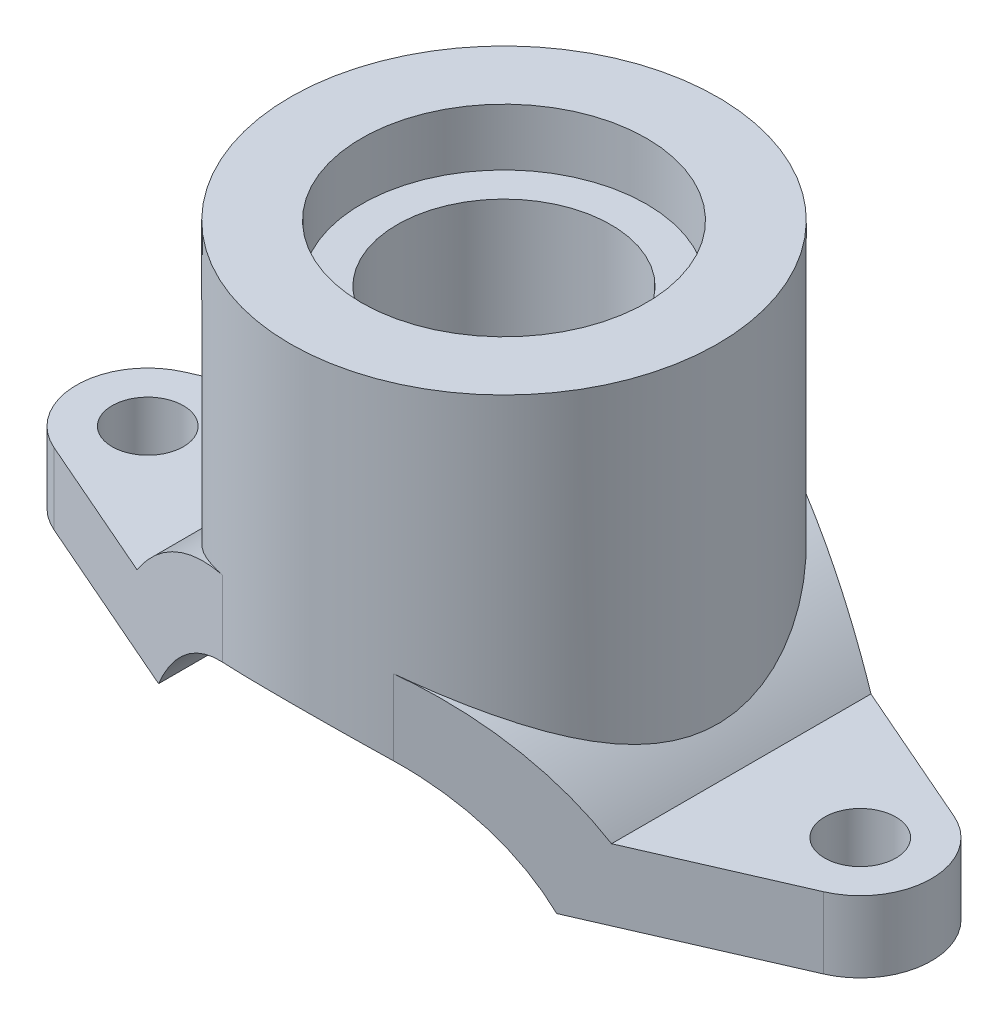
from build123d import *

# Parameters (mm, degrees)
BOSS_EXTRUDE1_DEPTH = 75
SKETCH2_OUTSIDE_W   = 370.368
SKETCH2_OUTSIDE_H   = 220.368
CUT_EXTRUDE1_DEPTH  = 223.162102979
BOSS_EXTRUDE2_REACH = 227
SKETCH3_R           = 75
SKETCH5_R           = 12.5
CUT_EXTRUDE2_DEPTH  = 210.165006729


with BuildPart() as part:
    # Sketch1 → Boss-Extrude1 (new, symmetric)
    with BuildSketch(Plane.XY):
        with BuildLine():
            Line((69.84983894, 0), (150, 0))
            Line((150, 0), (150, 25))
            Line((150, 25), (83.240615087, 25))
            ThreePointArc((83.240615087, 25), (0, 66), (-83.240615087, 25))
            Line((-83.240615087, 25), (-150, 25))
            Line((-150, 25), (-150, 0))
            Line((-150, 0), (-69.84983894, 0))
            ThreePointArc((-69.84983894, 0), (0, 41), (69.84983894, 0))
        make_face()
    extrude(amount=BOSS_EXTRUDE1_DEPTH, both=True)

    # Sketch2 outside → Cut-Extrude1 (cut, through all)
    with BuildSketch(Plane(origin=(0, 66, 75), x_dir=(-1, 0, 0), z_dir=(0, 1, 0))):
        with Locations((0, -75)):
            Rectangle(SKETCH2_OUTSIDE_W, SKETCH2_OUTSIDE_H)
        with BuildLine():
            Line((-135, -52.087121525), (-30, -6.261364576))
            ThreePointArc((-30, -6.261364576), (0, 0), (30, -6.261364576))
            Line((30, -6.261364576), (135, -52.087121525))
            ThreePointArc((135, -52.087121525), (150, -75), (135, -97.912878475))
            Line((135, -97.912878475), (30, -143.738635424))
            ThreePointArc((30, -143.738635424), (0, -150), (-30, -143.738635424))
            Line((-30, -143.738635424), (-135, -97.912878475))
            ThreePointArc((-135, -97.912878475), (-150, -75), (-135, -52.087121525))
        make_face(mode=Mode.SUBTRACT)
    extrude(amount=-CUT_EXTRUDE1_DEPTH, mode=Mode.SUBTRACT)

    # Sketch3 → Boss-Extrude2 (add, up to next)
    with BuildSketch(Plane(origin=(0, 150, 0), x_dir=(-1, 0, 0), z_dir=(0, 1, 0)), mode=Mode.PRIVATE) as boss_extrude2_sk1:
        with Locations(Location((0, 0, 0), (0, 0, 293.578178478))):
            Circle(SKETCH3_R)
    boss_extrude2_tool1 = extrude(boss_extrude2_sk1.sketch, amount=-BOSS_EXTRUDE2_REACH, mode=Mode.PRIVATE) - part.part
    add(boss_extrude2_tool1.solids().sort_by_distance((0, 150, 0))[0])

    # Sketch4 → Cut-Revolve1 (revolve, cut)
    with BuildSketch(Plane.XY, mode=Mode.PRIVATE) as cut_revolve1_sk:
        Polygon((0, 0), (0, 150), (50, 150), (50, 130), (37.5, 130), (37.5, 0), align=None)
    revolve(cut_revolve1_sk.sketch.rotate(Axis((0, 181.872549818, 0), (0, -1, 0)), 90), axis=Axis((0, 181.872549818, 0), (0, -1, 0)), mode=Mode.SUBTRACT)

    # Sketch5 → Cut-Extrude2 (cut, through all)
    with BuildSketch(Plane(origin=(0, 25, 0), x_dir=(1, 0, 0), z_dir=(0, 1, 0))):
        with Locations(Location((-125, 0, 0), (0, 0, 270))):
            Circle(SKETCH5_R)
        with Locations(Location((125, 0, 0), (0, 0, 270))):
            Circle(SKETCH5_R)
    extrude(amount=-CUT_EXTRUDE2_DEPTH, mode=Mode.SUBTRACT)


solid = part.part
